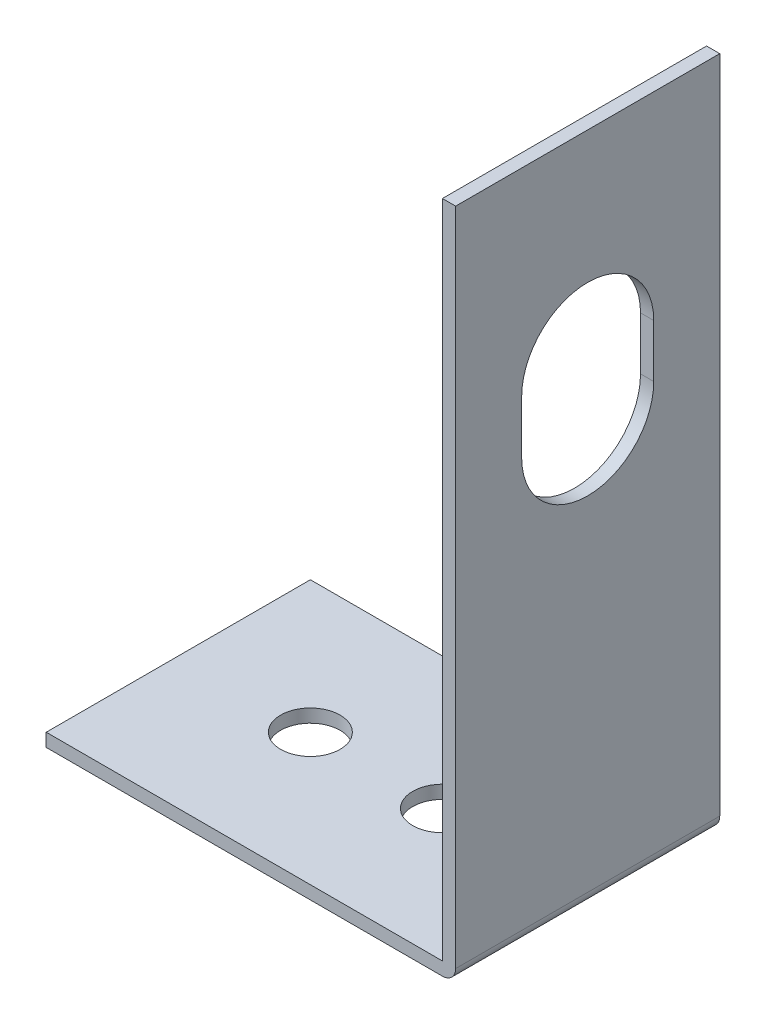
ISO-10303-21;
HEADER;
FILE_DESCRIPTION(('STEP AP214'),'2;1');
FILE_NAME('part.step','',(''),(''),'','','');
FILE_SCHEMA(('AUTOMOTIVE_DESIGN { 1 0 10303 214 1 1 1 1 }'));
ENDSEC;
DATA;
#1=APPLICATION_CONTEXT('core data for automotive mechanical design processes');
#2=APPLICATION_PROTOCOL_DEFINITION('international standard','automotive_design',2000,#1);
#3=PRODUCT_CONTEXT('',#1,'mechanical');
#4=PRODUCT('Part','Part','',(#3));
#5=PRODUCT_RELATED_PRODUCT_CATEGORY('part','',(#4));
#6=PRODUCT_DEFINITION_FORMATION('','',#4);
#7=PRODUCT_DEFINITION_CONTEXT('part definition',#1,'design');
#8=PRODUCT_DEFINITION('design','',#6,#7);
#9=PRODUCT_DEFINITION_SHAPE('','',#8);
#10=(LENGTH_UNIT() NAMED_UNIT(*) SI_UNIT(.MILLI.,.METRE.));
#11=(NAMED_UNIT(*) PLANE_ANGLE_UNIT() SI_UNIT($,.RADIAN.));
#12=(NAMED_UNIT(*) SI_UNIT($,.STERADIAN.) SOLID_ANGLE_UNIT());
#13=UNCERTAINTY_MEASURE_WITH_UNIT(LENGTH_MEASURE(1.E-05),#10,'distance_accuracy_value','');
#14=(GEOMETRIC_REPRESENTATION_CONTEXT(3) GLOBAL_UNCERTAINTY_ASSIGNED_CONTEXT((#13)) GLOBAL_UNIT_ASSIGNED_CONTEXT((#10,
#11,#12)) REPRESENTATION_CONTEXT('',''));
#15=CARTESIAN_POINT('',(0.,0.,0.));
#16=DIRECTION('',(0.,0.,1.));
#17=DIRECTION('',(1.,0.,0.));
#18=AXIS2_PLACEMENT_3D('',#15,#16,#17);
#19=CARTESIAN_POINT('',(0.,0.,20.));
#20=DIRECTION('',(0.,-1.,0.));
#21=DIRECTION('',(1.,0.,0.));
#22=AXIS2_PLACEMENT_3D('',#19,#20,#21);
#23=PLANE('',#22);
#24=CARTESIAN_POINT('',(-20.,0.,10.));
#25=DIRECTION('',(0.,1.,0.));
#26=DIRECTION('',(-1.,0.,0.));
#27=AXIS2_PLACEMENT_3D('',#24,#25,#26);
#28=CIRCLE('',#27,2.25);
#29=CARTESIAN_POINT('',(-22.25,0.,10.));
#30=VERTEX_POINT('',#29);
#31=EDGE_CURVE('E212',#30,#30,#28,.T.);
#32=ORIENTED_EDGE('',*,*,#31,.F.);
#33=EDGE_LOOP('',(#32));
#34=FACE_BOUND('',#33,.T.);
#35=CARTESIAN_POINT('',(-10.,0.,10.));
#36=DIRECTION('',(0.,1.,0.));
#37=DIRECTION('',(-1.,0.,0.));
#38=AXIS2_PLACEMENT_3D('',#35,#36,#37);
#39=CIRCLE('',#38,2.25);
#40=CARTESIAN_POINT('',(-12.25,0.,10.));
#41=VERTEX_POINT('',#40);
#42=EDGE_CURVE('E204',#41,#41,#39,.T.);
#43=ORIENTED_EDGE('',*,*,#42,.F.);
#44=EDGE_LOOP('',(#43));
#45=FACE_BOUND('',#44,.T.);
#46=DIRECTION('',(-1.,0.,0.));
#47=VECTOR('',#46,1.);
#48=CARTESIAN_POINT('',(0.,0.,0.));
#49=LINE('',#48,#47);
#50=CARTESIAN_POINT('',(0.,0.,0.));
#51=VERTEX_POINT('',#50);
#52=CARTESIAN_POINT('',(-30.,0.,0.));
#53=VERTEX_POINT('',#52);
#54=EDGE_CURVE('E156',#51,#53,#49,.T.);
#55=ORIENTED_EDGE('',*,*,#54,.T.);
#56=DIRECTION('',(0.,0.,-1.));
#57=VECTOR('',#56,1.);
#58=CARTESIAN_POINT('',(-30.,0.,20.));
#59=LINE('',#58,#57);
#60=CARTESIAN_POINT('',(-30.,0.,20.));
#61=VERTEX_POINT('',#60);
#62=EDGE_CURVE('E11',#61,#53,#59,.T.);
#63=ORIENTED_EDGE('',*,*,#62,.F.);
#64=DIRECTION('',(-1.,0.,0.));
#65=VECTOR('',#64,1.);
#66=CARTESIAN_POINT('',(0.,0.,20.));
#67=LINE('',#66,#65);
#68=CARTESIAN_POINT('',(0.,0.,20.));
#69=VERTEX_POINT('',#68);
#70=EDGE_CURVE('E171',#69,#61,#67,.T.);
#71=ORIENTED_EDGE('',*,*,#70,.F.);
#72=DIRECTION('',(0.,0.,-1.));
#73=VECTOR('',#72,1.);
#74=CARTESIAN_POINT('',(0.,0.,20.));
#75=LINE('',#74,#73);
#76=EDGE_CURVE('E186',#69,#51,#75,.T.);
#77=ORIENTED_EDGE('',*,*,#76,.T.);
#78=EDGE_LOOP('',(#55,#63,#71,#77));
#79=FACE_BOUND('',#78,.T.);
#80=ADVANCED_FACE('F35',(#34,#45,#79),#23,.F.);
#81=CARTESIAN_POINT('',(-30.,0.,20.));
#82=DIRECTION('',(1.,0.,0.));
#83=DIRECTION('',(0.,0.,-1.));
#84=AXIS2_PLACEMENT_3D('',#81,#82,#83);
#85=PLANE('',#84);
#86=DIRECTION('',(0.,-1.,0.));
#87=VECTOR('',#86,1.);
#88=CARTESIAN_POINT('',(-30.,0.,0.));
#89=LINE('',#88,#87);
#90=CARTESIAN_POINT('',(-30.,-1.,0.));
#91=VERTEX_POINT('',#90);
#92=EDGE_CURVE('E159',#53,#91,#89,.T.);
#93=ORIENTED_EDGE('',*,*,#92,.T.);
#94=DIRECTION('',(0.,0.,-1.));
#95=VECTOR('',#94,1.);
#96=CARTESIAN_POINT('',(-30.,-1.,20.));
#97=LINE('',#96,#95);
#98=CARTESIAN_POINT('',(-30.,-1.,20.));
#99=VERTEX_POINT('',#98);
#100=EDGE_CURVE('E43',#99,#91,#97,.T.);
#101=ORIENTED_EDGE('',*,*,#100,.F.);
#102=DIRECTION('',(0.,-1.,0.));
#103=VECTOR('',#102,1.);
#104=CARTESIAN_POINT('',(-30.,0.,20.));
#105=LINE('',#104,#103);
#106=EDGE_CURVE('E174',#61,#99,#105,.T.);
#107=ORIENTED_EDGE('',*,*,#106,.F.);
#108=ORIENTED_EDGE('',*,*,#62,.T.);
#109=EDGE_LOOP('',(#93,#101,#107,#108));
#110=FACE_BOUND('',#109,.T.);
#111=ADVANCED_FACE('F222',(#110),#85,.F.);
#112=CARTESIAN_POINT('',(0.,-0.999999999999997,20.));
#113=DIRECTION('',(0.,1.,0.));
#114=DIRECTION('',(-1.,0.,0.));
#115=AXIS2_PLACEMENT_3D('',#112,#113,#114);
#116=PLANE('',#115);
#117=CARTESIAN_POINT('',(-20.,-0.999999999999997,10.));
#118=DIRECTION('',(0.,1.,0.));
#119=DIRECTION('',(-1.,0.,0.));
#120=AXIS2_PLACEMENT_3D('',#117,#118,#119);
#121=CIRCLE('',#120,2.25);
#122=CARTESIAN_POINT('',(-22.25,-0.999999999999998,10.));
#123=VERTEX_POINT('',#122);
#124=EDGE_CURVE('E38',#123,#123,#121,.T.);
#125=ORIENTED_EDGE('',*,*,#124,.T.);
#126=EDGE_LOOP('',(#125));
#127=FACE_BOUND('',#126,.T.);
#128=CARTESIAN_POINT('',(-10.,-0.999999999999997,10.));
#129=DIRECTION('',(0.,1.,0.));
#130=DIRECTION('',(-1.,0.,0.));
#131=AXIS2_PLACEMENT_3D('',#128,#129,#130);
#132=CIRCLE('',#131,2.25);
#133=CARTESIAN_POINT('',(-12.25,-0.999999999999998,10.));
#134=VERTEX_POINT('',#133);
#135=EDGE_CURVE('E202',#134,#134,#132,.T.);
#136=ORIENTED_EDGE('',*,*,#135,.T.);
#137=EDGE_LOOP('',(#136));
#138=FACE_BOUND('',#137,.T.);
#139=DIRECTION('',(1.,0.,0.));
#140=VECTOR('',#139,1.);
#141=CARTESIAN_POINT('',(0.,-0.999999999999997,0.));
#142=LINE('',#141,#140);
#143=CARTESIAN_POINT('',(0.,-0.999999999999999,0.));
#144=VERTEX_POINT('',#143);
#145=EDGE_CURVE('E161',#91,#144,#142,.T.);
#146=ORIENTED_EDGE('',*,*,#145,.T.);
#147=DIRECTION('',(0.,0.,-1.));
#148=VECTOR('',#147,1.);
#149=CARTESIAN_POINT('',(0.,-0.999999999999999,20.));
#150=LINE('',#149,#148);
#151=CARTESIAN_POINT('',(0.,-0.999999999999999,20.));
#152=VERTEX_POINT('',#151);
#153=EDGE_CURVE('E198',#152,#144,#150,.T.);
#154=ORIENTED_EDGE('',*,*,#153,.F.);
#155=DIRECTION('',(1.,0.,0.));
#156=VECTOR('',#155,1.);
#157=CARTESIAN_POINT('',(0.,-0.999999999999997,20.));
#158=LINE('',#157,#156);
#159=EDGE_CURVE('E176',#99,#152,#158,.T.);
#160=ORIENTED_EDGE('',*,*,#159,.F.);
#161=ORIENTED_EDGE('',*,*,#100,.T.);
#162=EDGE_LOOP('',(#146,#154,#160,#161));
#163=FACE_BOUND('',#162,.T.);
#164=ADVANCED_FACE('F255',(#127,#138,#163),#116,.F.);
#165=CARTESIAN_POINT('',(0.,0.,20.));
#166=DIRECTION('',(0.,0.,-1.));
#167=DIRECTION('',(-1.,0.,0.));
#168=AXIS2_PLACEMENT_3D('',#165,#166,#167);
#169=CYLINDRICAL_SURFACE('',#168,0.999999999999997);
#170=CARTESIAN_POINT('',(0.,0.,0.));
#171=DIRECTION('',(0.,0.,1.));
#172=DIRECTION('',(1.,0.,0.));
#173=AXIS2_PLACEMENT_3D('',#170,#171,#172);
#174=CIRCLE('',#173,0.999999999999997);
#175=CARTESIAN_POINT('',(0.999999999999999,0.,0.));
#176=VERTEX_POINT('',#175);
#177=EDGE_CURVE('E163',#144,#176,#174,.T.);
#178=ORIENTED_EDGE('',*,*,#177,.T.);
#179=DIRECTION('',(0.,0.,-1.));
#180=VECTOR('',#179,1.);
#181=CARTESIAN_POINT('',(0.999999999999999,0.,20.));
#182=LINE('',#181,#180);
#183=CARTESIAN_POINT('',(0.999999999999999,0.,20.));
#184=VERTEX_POINT('',#183);
#185=EDGE_CURVE('E195',#184,#176,#182,.T.);
#186=ORIENTED_EDGE('',*,*,#185,.F.);
#187=CARTESIAN_POINT('',(0.,0.,20.));
#188=DIRECTION('',(0.,0.,1.));
#189=DIRECTION('',(1.,0.,0.));
#190=AXIS2_PLACEMENT_3D('',#187,#188,#189);
#191=CIRCLE('',#190,0.999999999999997);
#192=EDGE_CURVE('E178',#152,#184,#191,.T.);
#193=ORIENTED_EDGE('',*,*,#192,.F.);
#194=ORIENTED_EDGE('',*,*,#153,.T.);
#195=EDGE_LOOP('',(#178,#186,#193,#194));
#196=FACE_BOUND('',#195,.T.);
#197=ADVANCED_FACE('F252',(#196),#169,.T.);
#198=CARTESIAN_POINT('',(0.999999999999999,0.,20.));
#199=DIRECTION('',(-1.,0.,0.));
#200=DIRECTION('',(0.,-1.,0.));
#201=AXIS2_PLACEMENT_3D('',#198,#199,#200);
#202=PLANE('',#201);
#203=DIRECTION('',(0.,1.,0.));
#204=VECTOR('',#203,1.);
#205=CARTESIAN_POINT('',(0.999999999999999,0.,15.));
#206=LINE('',#205,#204);
#207=CARTESIAN_POINT('',(0.999999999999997,31.,15.));
#208=VERTEX_POINT('',#207);
#209=CARTESIAN_POINT('',(1.,35.,15.));
#210=VERTEX_POINT('',#209);
#211=EDGE_CURVE('E150',#208,#210,#206,.T.);
#212=ORIENTED_EDGE('',*,*,#211,.T.);
#213=CARTESIAN_POINT('',(0.999999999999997,35.,10.));
#214=DIRECTION('',(-1.,0.,0.));
#215=DIRECTION('',(0.,-1.,0.));
#216=AXIS2_PLACEMENT_3D('',#213,#214,#215);
#217=CIRCLE('',#216,5.);
#218=CARTESIAN_POINT('',(1.,35.,5.));
#219=VERTEX_POINT('',#218);
#220=EDGE_CURVE('E153',#210,#219,#217,.T.);
#221=ORIENTED_EDGE('',*,*,#220,.T.);
#222=DIRECTION('',(0.,-1.,0.));
#223=VECTOR('',#222,1.);
#224=CARTESIAN_POINT('',(0.999999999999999,0.,4.99999999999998));
#225=LINE('',#224,#223);
#226=CARTESIAN_POINT('',(1.,31.,5.));
#227=VERTEX_POINT('',#226);
#228=EDGE_CURVE('E145',#219,#227,#225,.T.);
#229=ORIENTED_EDGE('',*,*,#228,.T.);
#230=CARTESIAN_POINT('',(0.999999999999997,31.,10.));
#231=DIRECTION('',(-1.,0.,0.));
#232=DIRECTION('',(0.,-1.,0.));
#233=AXIS2_PLACEMENT_3D('',#230,#231,#232);
#234=CIRCLE('',#233,5.);
#235=EDGE_CURVE('E125',#227,#208,#234,.T.);
#236=ORIENTED_EDGE('',*,*,#235,.T.);
#237=EDGE_LOOP('',(#212,#221,#229,#236));
#238=FACE_BOUND('',#237,.T.);
#239=DIRECTION('',(0.,1.,0.));
#240=VECTOR('',#239,1.);
#241=CARTESIAN_POINT('',(0.999999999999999,0.,0.));
#242=LINE('',#241,#240);
#243=CARTESIAN_POINT('',(1.,50.,0.));
#244=VERTEX_POINT('',#243);
#245=EDGE_CURVE('E165',#176,#244,#242,.T.);
#246=ORIENTED_EDGE('',*,*,#245,.T.);
#247=DIRECTION('',(0.,0.,-1.));
#248=VECTOR('',#247,1.);
#249=CARTESIAN_POINT('',(1.,50.,20.));
#250=LINE('',#249,#248);
#251=CARTESIAN_POINT('',(1.,50.,20.));
#252=VERTEX_POINT('',#251);
#253=EDGE_CURVE('E192',#252,#244,#250,.T.);
#254=ORIENTED_EDGE('',*,*,#253,.F.);
#255=DIRECTION('',(0.,1.,0.));
#256=VECTOR('',#255,1.);
#257=CARTESIAN_POINT('',(0.999999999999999,0.,20.));
#258=LINE('',#257,#256);
#259=EDGE_CURVE('E180',#184,#252,#258,.T.);
#260=ORIENTED_EDGE('',*,*,#259,.F.);
#261=ORIENTED_EDGE('',*,*,#185,.T.);
#262=EDGE_LOOP('',(#246,#254,#260,#261));
#263=FACE_BOUND('',#262,.T.);
#264=ADVANCED_FACE('F247',(#238,#263),#202,.F.);
#265=CARTESIAN_POINT('',(0.,50.,20.));
#266=DIRECTION('',(0.,-1.,0.));
#267=DIRECTION('',(0.,0.,-1.));
#268=AXIS2_PLACEMENT_3D('',#265,#266,#267);
#269=PLANE('',#268);
#270=DIRECTION('',(-1.,0.,0.));
#271=VECTOR('',#270,1.);
#272=CARTESIAN_POINT('',(0.,50.,0.));
#273=LINE('',#272,#271);
#274=CARTESIAN_POINT('',(0.,50.,0.));
#275=VERTEX_POINT('',#274);
#276=EDGE_CURVE('E167',#244,#275,#273,.T.);
#277=ORIENTED_EDGE('',*,*,#276,.T.);
#278=DIRECTION('',(0.,0.,-1.));
#279=VECTOR('',#278,1.);
#280=CARTESIAN_POINT('',(0.,50.,20.));
#281=LINE('',#280,#279);
#282=CARTESIAN_POINT('',(0.,50.,20.));
#283=VERTEX_POINT('',#282);
#284=EDGE_CURVE('E189',#283,#275,#281,.T.);
#285=ORIENTED_EDGE('',*,*,#284,.F.);
#286=DIRECTION('',(-1.,0.,0.));
#287=VECTOR('',#286,1.);
#288=CARTESIAN_POINT('',(0.,50.,20.));
#289=LINE('',#288,#287);
#290=EDGE_CURVE('E182',#252,#283,#289,.T.);
#291=ORIENTED_EDGE('',*,*,#290,.F.);
#292=ORIENTED_EDGE('',*,*,#253,.T.);
#293=EDGE_LOOP('',(#277,#285,#291,#292));
#294=FACE_BOUND('',#293,.T.);
#295=ADVANCED_FACE('F243',(#294),#269,.F.);
#296=CARTESIAN_POINT('',(0.,0.,20.));
#297=DIRECTION('',(1.,0.,0.));
#298=DIRECTION('',(0.,0.,-1.));
#299=AXIS2_PLACEMENT_3D('',#296,#297,#298);
#300=PLANE('',#299);
#301=DIRECTION('',(0.,-1.,0.));
#302=VECTOR('',#301,1.);
#303=CARTESIAN_POINT('',(0.,35.,5.));
#304=LINE('',#303,#302);
#305=CARTESIAN_POINT('',(0.,35.,5.));
#306=VERTEX_POINT('',#305);
#307=CARTESIAN_POINT('',(0.,31.,5.));
#308=VERTEX_POINT('',#307);
#309=EDGE_CURVE('E131',#306,#308,#304,.T.);
#310=ORIENTED_EDGE('',*,*,#309,.F.);
#311=CARTESIAN_POINT('',(0.,35.,10.));
#312=DIRECTION('',(-1.,0.,0.));
#313=DIRECTION('',(0.,0.,1.));
#314=AXIS2_PLACEMENT_3D('',#311,#312,#313);
#315=CIRCLE('',#314,5.);
#316=CARTESIAN_POINT('',(0.,35.,15.));
#317=VERTEX_POINT('',#316);
#318=EDGE_CURVE('E59',#317,#306,#315,.T.);
#319=ORIENTED_EDGE('',*,*,#318,.F.);
#320=DIRECTION('',(0.,1.,0.));
#321=VECTOR('',#320,1.);
#322=CARTESIAN_POINT('',(0.,35.,15.));
#323=LINE('',#322,#321);
#324=CARTESIAN_POINT('',(0.,31.,15.));
#325=VERTEX_POINT('',#324);
#326=EDGE_CURVE('E138',#325,#317,#323,.T.);
#327=ORIENTED_EDGE('',*,*,#326,.F.);
#328=CARTESIAN_POINT('',(0.,31.,10.));
#329=DIRECTION('',(-1.,0.,0.));
#330=DIRECTION('',(0.,0.,1.));
#331=AXIS2_PLACEMENT_3D('',#328,#329,#330);
#332=CIRCLE('',#331,5.);
#333=EDGE_CURVE('E122',#308,#325,#332,.T.);
#334=ORIENTED_EDGE('',*,*,#333,.F.);
#335=EDGE_LOOP('',(#310,#319,#327,#334));
#336=FACE_BOUND('',#335,.T.);
#337=DIRECTION('',(0.,-1.,0.));
#338=VECTOR('',#337,1.);
#339=CARTESIAN_POINT('',(0.,0.,0.));
#340=LINE('',#339,#338);
#341=EDGE_CURVE('E169',#275,#51,#340,.T.);
#342=ORIENTED_EDGE('',*,*,#341,.T.);
#343=ORIENTED_EDGE('',*,*,#76,.F.);
#344=DIRECTION('',(0.,-1.,0.));
#345=VECTOR('',#344,1.);
#346=CARTESIAN_POINT('',(0.,0.,20.));
#347=LINE('',#346,#345);
#348=EDGE_CURVE('E184',#283,#69,#347,.T.);
#349=ORIENTED_EDGE('',*,*,#348,.F.);
#350=ORIENTED_EDGE('',*,*,#284,.T.);
#351=EDGE_LOOP('',(#342,#343,#349,#350));
#352=FACE_BOUND('',#351,.T.);
#353=ADVANCED_FACE('F135',(#336,#352),#300,.F.);
#354=CARTESIAN_POINT('',(0.,0.,20.));
#355=DIRECTION('',(0.,0.,1.));
#356=DIRECTION('',(1.,0.,0.));
#357=AXIS2_PLACEMENT_3D('',#354,#355,#356);
#358=PLANE('',#357);
#359=ORIENTED_EDGE('',*,*,#70,.T.);
#360=ORIENTED_EDGE('',*,*,#106,.T.);
#361=ORIENTED_EDGE('',*,*,#159,.T.);
#362=ORIENTED_EDGE('',*,*,#192,.T.);
#363=ORIENTED_EDGE('',*,*,#259,.T.);
#364=ORIENTED_EDGE('',*,*,#290,.T.);
#365=ORIENTED_EDGE('',*,*,#348,.T.);
#366=EDGE_LOOP('',(#359,#360,#361,#362,#363,#364,#365));
#367=FACE_BOUND('',#366,.T.);
#368=ADVANCED_FACE('F238',(#367),#358,.T.);
#369=CARTESIAN_POINT('',(0.,0.,0.));
#370=DIRECTION('',(0.,0.,1.));
#371=DIRECTION('',(1.,0.,0.));
#372=AXIS2_PLACEMENT_3D('',#369,#370,#371);
#373=PLANE('',#372);
#374=ORIENTED_EDGE('',*,*,#54,.F.);
#375=ORIENTED_EDGE('',*,*,#341,.F.);
#376=ORIENTED_EDGE('',*,*,#276,.F.);
#377=ORIENTED_EDGE('',*,*,#245,.F.);
#378=ORIENTED_EDGE('',*,*,#177,.F.);
#379=ORIENTED_EDGE('',*,*,#145,.F.);
#380=ORIENTED_EDGE('',*,*,#92,.F.);
#381=EDGE_LOOP('',(#374,#375,#376,#377,#378,#379,#380));
#382=FACE_BOUND('',#381,.T.);
#383=ADVANCED_FACE('F230',(#382),#373,.F.);
#384=CARTESIAN_POINT('',(20.,35.,10.));
#385=DIRECTION('',(-1.,0.,0.));
#386=DIRECTION('',(0.,0.,1.));
#387=AXIS2_PLACEMENT_3D('',#384,#385,#386);
#388=CYLINDRICAL_SURFACE('',#387,5.);
#389=DIRECTION('',(-1.,0.,0.));
#390=VECTOR('',#389,1.);
#391=CARTESIAN_POINT('',(20.,35.,15.));
#392=LINE('',#391,#390);
#393=EDGE_CURVE('E143',#210,#317,#392,.T.);
#394=ORIENTED_EDGE('',*,*,#393,.T.);
#395=ORIENTED_EDGE('',*,*,#318,.T.);
#396=DIRECTION('',(-1.,0.,0.));
#397=VECTOR('',#396,1.);
#398=CARTESIAN_POINT('',(20.,35.,5.));
#399=LINE('',#398,#397);
#400=EDGE_CURVE('E128',#219,#306,#399,.T.);
#401=ORIENTED_EDGE('',*,*,#400,.F.);
#402=ORIENTED_EDGE('',*,*,#220,.F.);
#403=EDGE_LOOP('',(#394,#395,#401,#402));
#404=FACE_BOUND('',#403,.T.);
#405=ADVANCED_FACE('F276',(#404),#388,.F.);
#406=CARTESIAN_POINT('',(20.,35.,15.));
#407=DIRECTION('',(0.,0.,1.));
#408=DIRECTION('',(0.,-1.,0.));
#409=AXIS2_PLACEMENT_3D('',#406,#407,#408);
#410=PLANE('',#409);
#411=DIRECTION('',(-1.,0.,0.));
#412=VECTOR('',#411,1.);
#413=CARTESIAN_POINT('',(20.,31.,15.));
#414=LINE('',#413,#412);
#415=EDGE_CURVE('E127',#208,#325,#414,.T.);
#416=ORIENTED_EDGE('',*,*,#415,.T.);
#417=ORIENTED_EDGE('',*,*,#326,.T.);
#418=ORIENTED_EDGE('',*,*,#393,.F.);
#419=ORIENTED_EDGE('',*,*,#211,.F.);
#420=EDGE_LOOP('',(#416,#417,#418,#419));
#421=FACE_BOUND('',#420,.T.);
#422=ADVANCED_FACE('F279',(#421),#410,.F.);
#423=CARTESIAN_POINT('',(20.,31.,10.));
#424=DIRECTION('',(-1.,0.,0.));
#425=DIRECTION('',(0.,0.,1.));
#426=AXIS2_PLACEMENT_3D('',#423,#424,#425);
#427=CYLINDRICAL_SURFACE('',#426,5.);
#428=DIRECTION('',(-1.,0.,0.));
#429=VECTOR('',#428,1.);
#430=CARTESIAN_POINT('',(20.,31.,5.));
#431=LINE('',#430,#429);
#432=EDGE_CURVE('E51',#227,#308,#431,.T.);
#433=ORIENTED_EDGE('',*,*,#432,.T.);
#434=ORIENTED_EDGE('',*,*,#333,.T.);
#435=ORIENTED_EDGE('',*,*,#415,.F.);
#436=ORIENTED_EDGE('',*,*,#235,.F.);
#437=EDGE_LOOP('',(#433,#434,#435,#436));
#438=FACE_BOUND('',#437,.T.);
#439=ADVANCED_FACE('F119',(#438),#427,.F.);
#440=CARTESIAN_POINT('',(20.,35.,5.));
#441=DIRECTION('',(0.,0.,-1.));
#442=DIRECTION('',(0.,1.,0.));
#443=AXIS2_PLACEMENT_3D('',#440,#441,#442);
#444=PLANE('',#443);
#445=ORIENTED_EDGE('',*,*,#400,.T.);
#446=ORIENTED_EDGE('',*,*,#309,.T.);
#447=ORIENTED_EDGE('',*,*,#432,.F.);
#448=ORIENTED_EDGE('',*,*,#228,.F.);
#449=EDGE_LOOP('',(#445,#446,#447,#448));
#450=FACE_BOUND('',#449,.T.);
#451=ADVANCED_FACE('F132',(#450),#444,.F.);
#452=CARTESIAN_POINT('',(-9.99999999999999,-20.,10.));
#453=DIRECTION('',(0.,1.,0.));
#454=DIRECTION('',(-1.,0.,0.));
#455=AXIS2_PLACEMENT_3D('',#452,#453,#454);
#456=CYLINDRICAL_SURFACE('',#455,2.25);
#457=ORIENTED_EDGE('',*,*,#42,.T.);
#458=EDGE_LOOP('',(#457));
#459=FACE_BOUND('',#458,.T.);
#460=ORIENTED_EDGE('',*,*,#135,.F.);
#461=EDGE_LOOP('',(#460));
#462=FACE_BOUND('',#461,.T.);
#463=ADVANCED_FACE('F282',(#459,#462),#456,.F.);
#464=CARTESIAN_POINT('',(-20.,-20.,10.));
#465=DIRECTION('',(0.,1.,0.));
#466=DIRECTION('',(-1.,0.,0.));
#467=AXIS2_PLACEMENT_3D('',#464,#465,#466);
#468=CYLINDRICAL_SURFACE('',#467,2.25);
#469=ORIENTED_EDGE('',*,*,#31,.T.);
#470=EDGE_LOOP('',(#469));
#471=FACE_BOUND('',#470,.T.);
#472=ORIENTED_EDGE('',*,*,#124,.F.);
#473=EDGE_LOOP('',(#472));
#474=FACE_BOUND('',#473,.T.);
#475=ADVANCED_FACE('F217',(#471,#474),#468,.F.);
#476=CLOSED_SHELL('',(#80,#111,#164,#197,#264,#295,#353,#368,#383,#405,#422,#439,#451,#463,#475));
#477=MANIFOLD_SOLID_BREP('B2',#476);
#478=ADVANCED_BREP_SHAPE_REPRESENTATION('',(#18,#477),#14);
#479=SHAPE_DEFINITION_REPRESENTATION(#9,#478);
ENDSEC;
END-ISO-10303-21;
